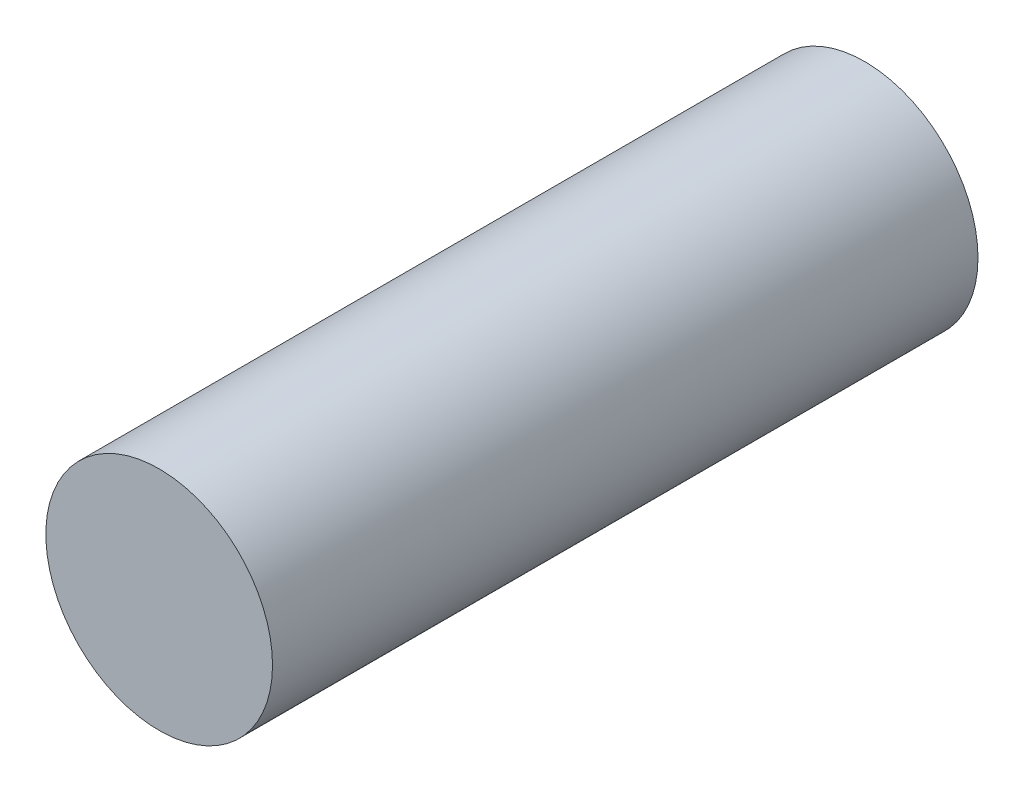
from build123d import *

# Parameters (mm, degrees)
SKETCH1_W = 277
SKETCH1_H = 44.5


with BuildPart() as part:
    # Sketch1 → Revolve1 (revolve)
    with BuildSketch(Plane(origin=(0, 0, 0), x_dir=(0, 0, -1), z_dir=(1, 0, 0)), mode=Mode.PRIVATE) as revolve1_sk:
        with Locations((138.5, 22.25)):
            Rectangle(SKETCH1_W, SKETCH1_H)
    revolve(revolve1_sk.sketch.rotate(Axis((0, 0, 0), (0, 0, -1)), 90), axis=Axis((0, 0, 0), (0, 0, -1)))


solid = part.part
